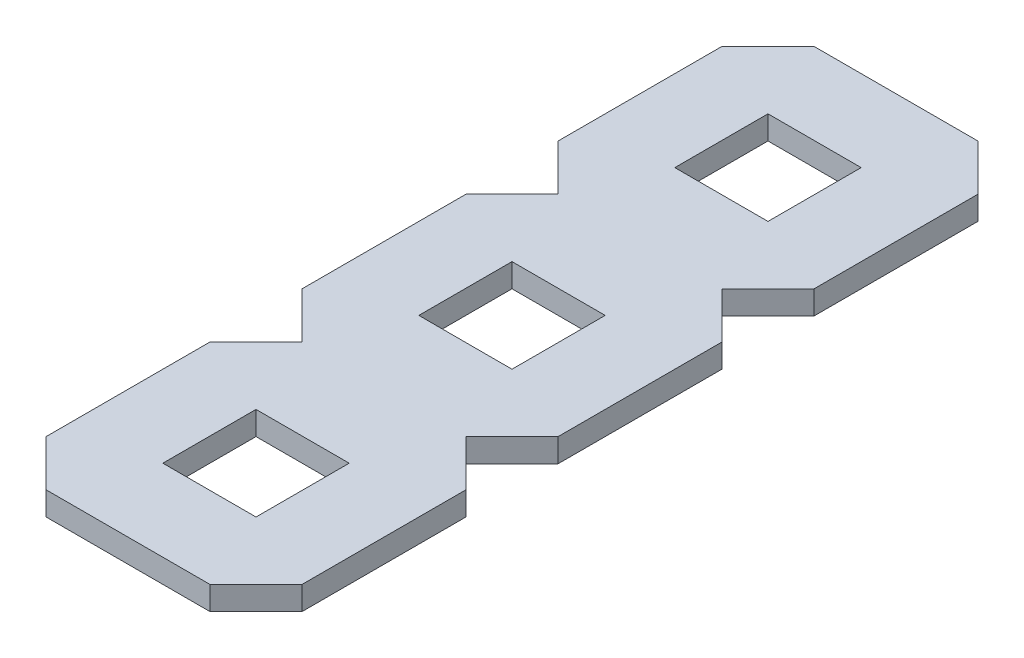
ISO-10303-21;
HEADER;
FILE_DESCRIPTION(('STEP AP214'),'2;1');
FILE_NAME('part.step','',(''),(''),'','','');
FILE_SCHEMA(('AUTOMOTIVE_DESIGN { 1 0 10303 214 1 1 1 1 }'));
ENDSEC;
DATA;
#1=APPLICATION_CONTEXT('core data for automotive mechanical design processes');
#2=APPLICATION_PROTOCOL_DEFINITION('international standard','automotive_design',2000,#1);
#3=PRODUCT_CONTEXT('',#1,'mechanical');
#4=PRODUCT('Part','Part','',(#3));
#5=PRODUCT_RELATED_PRODUCT_CATEGORY('part','',(#4));
#6=PRODUCT_DEFINITION_FORMATION('','',#4);
#7=PRODUCT_DEFINITION_CONTEXT('part definition',#1,'design');
#8=PRODUCT_DEFINITION('design','',#6,#7);
#9=PRODUCT_DEFINITION_SHAPE('','',#8);
#10=(LENGTH_UNIT() NAMED_UNIT(*) SI_UNIT(.MILLI.,.METRE.));
#11=(NAMED_UNIT(*) PLANE_ANGLE_UNIT() SI_UNIT($,.RADIAN.));
#12=(NAMED_UNIT(*) SI_UNIT($,.STERADIAN.) SOLID_ANGLE_UNIT());
#13=UNCERTAINTY_MEASURE_WITH_UNIT(LENGTH_MEASURE(1.E-05),#10,'distance_accuracy_value','');
#14=(GEOMETRIC_REPRESENTATION_CONTEXT(3) GLOBAL_UNCERTAINTY_ASSIGNED_CONTEXT((#13)) GLOBAL_UNIT_ASSIGNED_CONTEXT((#10,
#11,#12)) REPRESENTATION_CONTEXT('',''));
#15=CARTESIAN_POINT('',(0.,0.,0.));
#16=DIRECTION('',(0.,0.,1.));
#17=DIRECTION('',(1.,0.,0.));
#18=AXIS2_PLACEMENT_3D('',#15,#16,#17);
#19=CARTESIAN_POINT('',(0.,0.,-27.6809850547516));
#20=DIRECTION('',(-0.70710678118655,0.,0.707106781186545));
#21=DIRECTION('',(0.707106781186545,0.,0.70710678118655));
#22=AXIS2_PLACEMENT_3D('',#19,#20,#21);
#23=PLANE('',#22);
#24=DIRECTION('',(0.707106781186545,0.,0.70710678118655));
#25=VECTOR('',#24,1.);
#26=CARTESIAN_POINT('',(0.,1.1684,-27.6809850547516));
#27=LINE('',#26,#25);
#28=CARTESIAN_POINT('',(0.,1.1684,-27.6809850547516));
#29=VERTEX_POINT('',#28);
#30=CARTESIAN_POINT('',(2.28098505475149,1.1684,-25.4));
#31=VERTEX_POINT('',#30);
#32=EDGE_CURVE('E285',#29,#31,#27,.T.);
#33=ORIENTED_EDGE('',*,*,#32,.F.);
#34=DIRECTION('',(0.,1.,0.));
#35=VECTOR('',#34,1.);
#36=CARTESIAN_POINT('',(0.,0.,-27.6809850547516));
#37=LINE('',#36,#35);
#38=CARTESIAN_POINT('',(0.,0.,-27.6809850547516));
#39=VERTEX_POINT('',#38);
#40=EDGE_CURVE('E41',#39,#29,#37,.T.);
#41=ORIENTED_EDGE('',*,*,#40,.F.);
#42=DIRECTION('',(0.707106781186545,0.,0.70710678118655));
#43=VECTOR('',#42,1.);
#44=CARTESIAN_POINT('',(0.,0.,-27.6809850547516));
#45=LINE('',#44,#43);
#46=CARTESIAN_POINT('',(2.28098505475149,0.,-25.4));
#47=VERTEX_POINT('',#46);
#48=EDGE_CURVE('E306',#39,#47,#45,.T.);
#49=ORIENTED_EDGE('',*,*,#48,.T.);
#50=DIRECTION('',(0.,1.,0.));
#51=VECTOR('',#50,1.);
#52=CARTESIAN_POINT('',(2.28098505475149,0.,-25.4));
#53=LINE('',#52,#51);
#54=EDGE_CURVE('E11',#47,#31,#53,.T.);
#55=ORIENTED_EDGE('',*,*,#54,.T.);
#56=EDGE_LOOP('',(#33,#41,#49,#55));
#57=FACE_BOUND('',#56,.T.);
#58=ADVANCED_FACE('F32',(#57),#23,.T.);
#59=CARTESIAN_POINT('',(0.,0.,-35.8190149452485));
#60=DIRECTION('',(-1.,0.,0.));
#61=DIRECTION('',(0.,0.,1.));
#62=AXIS2_PLACEMENT_3D('',#59,#60,#61);
#63=PLANE('',#62);
#64=DIRECTION('',(0.,0.,1.));
#65=VECTOR('',#64,1.);
#66=CARTESIAN_POINT('',(0.,1.1684,-35.8190149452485));
#67=LINE('',#66,#65);
#68=CARTESIAN_POINT('',(0.,1.1684,-35.8190149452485));
#69=VERTEX_POINT('',#68);
#70=EDGE_CURVE('E329',#69,#29,#67,.T.);
#71=ORIENTED_EDGE('',*,*,#70,.F.);
#72=DIRECTION('',(0.,1.,0.));
#73=VECTOR('',#72,1.);
#74=CARTESIAN_POINT('',(0.,0.,-35.8190149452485));
#75=LINE('',#74,#73);
#76=CARTESIAN_POINT('',(0.,0.,-35.8190149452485));
#77=VERTEX_POINT('',#76);
#78=EDGE_CURVE('E335',#77,#69,#75,.T.);
#79=ORIENTED_EDGE('',*,*,#78,.F.);
#80=DIRECTION('',(0.,0.,1.));
#81=VECTOR('',#80,1.);
#82=CARTESIAN_POINT('',(0.,0.,-35.8190149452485));
#83=LINE('',#82,#81);
#84=EDGE_CURVE('E303',#77,#39,#83,.T.);
#85=ORIENTED_EDGE('',*,*,#84,.T.);
#86=ORIENTED_EDGE('',*,*,#40,.T.);
#87=EDGE_LOOP('',(#71,#79,#85,#86));
#88=FACE_BOUND('',#87,.T.);
#89=ADVANCED_FACE('F371',(#88),#63,.T.);
#90=CARTESIAN_POINT('',(2.28098505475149,0.,-38.1));
#91=DIRECTION('',(-0.707106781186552,0.,-0.707106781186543));
#92=DIRECTION('',(-0.707106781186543,0.,0.707106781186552));
#93=AXIS2_PLACEMENT_3D('',#90,#91,#92);
#94=PLANE('',#93);
#95=DIRECTION('',(-0.707106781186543,0.,0.707106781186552));
#96=VECTOR('',#95,1.);
#97=CARTESIAN_POINT('',(2.28098505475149,1.1684,-38.1));
#98=LINE('',#97,#96);
#99=CARTESIAN_POINT('',(2.28098505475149,1.1684,-38.1));
#100=VERTEX_POINT('',#99);
#101=EDGE_CURVE('E326',#100,#69,#98,.T.);
#102=ORIENTED_EDGE('',*,*,#101,.F.);
#103=DIRECTION('',(0.,1.,0.));
#104=VECTOR('',#103,1.);
#105=CARTESIAN_POINT('',(2.28098505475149,0.,-38.1));
#106=LINE('',#105,#104);
#107=CARTESIAN_POINT('',(2.28098505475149,0.,-38.1));
#108=VERTEX_POINT('',#107);
#109=EDGE_CURVE('E337',#108,#100,#106,.T.);
#110=ORIENTED_EDGE('',*,*,#109,.F.);
#111=DIRECTION('',(-0.707106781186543,0.,0.707106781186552));
#112=VECTOR('',#111,1.);
#113=CARTESIAN_POINT('',(2.28098505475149,0.,-38.1));
#114=LINE('',#113,#112);
#115=EDGE_CURVE('E300',#108,#77,#114,.T.);
#116=ORIENTED_EDGE('',*,*,#115,.T.);
#117=ORIENTED_EDGE('',*,*,#78,.T.);
#118=EDGE_LOOP('',(#102,#110,#116,#117));
#119=FACE_BOUND('',#118,.T.);
#120=ADVANCED_FACE('F377',(#119),#94,.T.);
#121=CARTESIAN_POINT('',(0.,0.,-40.3809850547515));
#122=DIRECTION('',(-0.707106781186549,0.,0.707106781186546));
#123=DIRECTION('',(0.707106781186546,0.,0.707106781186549));
#124=AXIS2_PLACEMENT_3D('',#121,#122,#123);
#125=PLANE('',#124);
#126=DIRECTION('',(0.707106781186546,0.,0.707106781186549));
#127=VECTOR('',#126,1.);
#128=CARTESIAN_POINT('',(0.,1.1684,-40.3809850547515));
#129=LINE('',#128,#127);
#130=CARTESIAN_POINT('',(0.,1.1684,-40.3809850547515));
#131=VERTEX_POINT('',#130);
#132=EDGE_CURVE('E323',#131,#100,#129,.T.);
#133=ORIENTED_EDGE('',*,*,#132,.F.);
#134=DIRECTION('',(0.,1.,0.));
#135=VECTOR('',#134,1.);
#136=CARTESIAN_POINT('',(0.,0.,-40.3809850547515));
#137=LINE('',#136,#135);
#138=CARTESIAN_POINT('',(0.,0.,-40.3809850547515));
#139=VERTEX_POINT('',#138);
#140=EDGE_CURVE('E339',#139,#131,#137,.T.);
#141=ORIENTED_EDGE('',*,*,#140,.F.);
#142=DIRECTION('',(0.707106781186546,0.,0.707106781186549));
#143=VECTOR('',#142,1.);
#144=CARTESIAN_POINT('',(0.,0.,-40.3809850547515));
#145=LINE('',#144,#143);
#146=EDGE_CURVE('E297',#139,#108,#145,.T.);
#147=ORIENTED_EDGE('',*,*,#146,.T.);
#148=ORIENTED_EDGE('',*,*,#109,.T.);
#149=EDGE_LOOP('',(#133,#141,#147,#148));
#150=FACE_BOUND('',#149,.T.);
#151=ADVANCED_FACE('F385',(#150),#125,.T.);
#152=CARTESIAN_POINT('',(0.,0.,-48.5190149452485));
#153=DIRECTION('',(-1.,0.,0.));
#154=DIRECTION('',(0.,0.,1.));
#155=AXIS2_PLACEMENT_3D('',#152,#153,#154);
#156=PLANE('',#155);
#157=DIRECTION('',(0.,0.,1.));
#158=VECTOR('',#157,1.);
#159=CARTESIAN_POINT('',(0.,1.1684,-48.5190149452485));
#160=LINE('',#159,#158);
#161=CARTESIAN_POINT('',(0.,1.1684,-48.5190149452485));
#162=VERTEX_POINT('',#161);
#163=EDGE_CURVE('E320',#162,#131,#160,.T.);
#164=ORIENTED_EDGE('',*,*,#163,.F.);
#165=DIRECTION('',(0.,1.,0.));
#166=VECTOR('',#165,1.);
#167=CARTESIAN_POINT('',(0.,0.,-48.5190149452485));
#168=LINE('',#167,#166);
#169=CARTESIAN_POINT('',(0.,0.,-48.5190149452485));
#170=VERTEX_POINT('',#169);
#171=EDGE_CURVE('E341',#170,#162,#168,.T.);
#172=ORIENTED_EDGE('',*,*,#171,.F.);
#173=DIRECTION('',(0.,0.,1.));
#174=VECTOR('',#173,1.);
#175=CARTESIAN_POINT('',(0.,0.,-48.5190149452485));
#176=LINE('',#175,#174);
#177=EDGE_CURVE('E294',#170,#139,#176,.T.);
#178=ORIENTED_EDGE('',*,*,#177,.T.);
#179=ORIENTED_EDGE('',*,*,#140,.T.);
#180=EDGE_LOOP('',(#164,#172,#178,#179));
#181=FACE_BOUND('',#180,.T.);
#182=ADVANCED_FACE('F389',(#181),#156,.T.);
#183=CARTESIAN_POINT('',(2.28098505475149,0.,-50.8));
#184=DIRECTION('',(-0.707106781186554,0.,-0.707106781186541));
#185=DIRECTION('',(-0.707106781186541,0.,0.707106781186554));
#186=AXIS2_PLACEMENT_3D('',#183,#184,#185);
#187=PLANE('',#186);
#188=DIRECTION('',(-0.707106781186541,0.,0.707106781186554));
#189=VECTOR('',#188,1.);
#190=CARTESIAN_POINT('',(2.28098505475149,1.1684,-50.8));
#191=LINE('',#190,#189);
#192=CARTESIAN_POINT('',(2.28098505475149,1.1684,-50.8));
#193=VERTEX_POINT('',#192);
#194=EDGE_CURVE('E317',#193,#162,#191,.T.);
#195=ORIENTED_EDGE('',*,*,#194,.F.);
#196=DIRECTION('',(0.,1.,0.));
#197=VECTOR('',#196,1.);
#198=CARTESIAN_POINT('',(2.28098505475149,0.,-50.8));
#199=LINE('',#198,#197);
#200=CARTESIAN_POINT('',(2.28098505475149,0.,-50.8));
#201=VERTEX_POINT('',#200);
#202=EDGE_CURVE('E343',#201,#193,#199,.T.);
#203=ORIENTED_EDGE('',*,*,#202,.F.);
#204=DIRECTION('',(-0.707106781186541,0.,0.707106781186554));
#205=VECTOR('',#204,1.);
#206=CARTESIAN_POINT('',(2.28098505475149,0.,-50.8));
#207=LINE('',#206,#205);
#208=EDGE_CURVE('E291',#201,#170,#207,.T.);
#209=ORIENTED_EDGE('',*,*,#208,.T.);
#210=ORIENTED_EDGE('',*,*,#171,.T.);
#211=EDGE_LOOP('',(#195,#203,#209,#210));
#212=FACE_BOUND('',#211,.T.);
#213=ADVANCED_FACE('F393',(#212),#187,.T.);
#214=CARTESIAN_POINT('',(0.,0.,-53.0809850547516));
#215=DIRECTION('',(-0.707106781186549,0.,0.707106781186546));
#216=DIRECTION('',(0.707106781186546,0.,0.707106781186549));
#217=AXIS2_PLACEMENT_3D('',#214,#215,#216);
#218=PLANE('',#217);
#219=DIRECTION('',(0.707106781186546,0.,0.707106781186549));
#220=VECTOR('',#219,1.);
#221=CARTESIAN_POINT('',(0.,1.1684,-53.0809850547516));
#222=LINE('',#221,#220);
#223=CARTESIAN_POINT('',(0.,1.1684,-53.0809850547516));
#224=VERTEX_POINT('',#223);
#225=EDGE_CURVE('E314',#224,#193,#222,.T.);
#226=ORIENTED_EDGE('',*,*,#225,.F.);
#227=DIRECTION('',(0.,1.,0.));
#228=VECTOR('',#227,1.);
#229=CARTESIAN_POINT('',(0.,0.,-53.0809850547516));
#230=LINE('',#229,#228);
#231=CARTESIAN_POINT('',(0.,0.,-53.0809850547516));
#232=VERTEX_POINT('',#231);
#233=EDGE_CURVE('E345',#232,#224,#230,.T.);
#234=ORIENTED_EDGE('',*,*,#233,.F.);
#235=DIRECTION('',(0.707106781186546,0.,0.707106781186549));
#236=VECTOR('',#235,1.);
#237=CARTESIAN_POINT('',(0.,0.,-53.0809850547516));
#238=LINE('',#237,#236);
#239=EDGE_CURVE('E288',#232,#201,#238,.T.);
#240=ORIENTED_EDGE('',*,*,#239,.T.);
#241=ORIENTED_EDGE('',*,*,#202,.T.);
#242=EDGE_LOOP('',(#226,#234,#240,#241));
#243=FACE_BOUND('',#242,.T.);
#244=ADVANCED_FACE('F368',(#243),#218,.T.);
#245=CARTESIAN_POINT('',(0.,0.,-61.2190149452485));
#246=DIRECTION('',(-1.,0.,0.));
#247=DIRECTION('',(0.,0.,1.));
#248=AXIS2_PLACEMENT_3D('',#245,#246,#247);
#249=PLANE('',#248);
#250=DIRECTION('',(0.,0.,1.));
#251=VECTOR('',#250,1.);
#252=CARTESIAN_POINT('',(0.,1.1684,-61.2190149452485));
#253=LINE('',#252,#251);
#254=CARTESIAN_POINT('',(0.,1.1684,-61.2190149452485));
#255=VERTEX_POINT('',#254);
#256=EDGE_CURVE('E311',#255,#224,#253,.T.);
#257=ORIENTED_EDGE('',*,*,#256,.F.);
#258=DIRECTION('',(0.,1.,0.));
#259=VECTOR('',#258,1.);
#260=CARTESIAN_POINT('',(0.,0.,-61.2190149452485));
#261=LINE('',#260,#259);
#262=CARTESIAN_POINT('',(0.,0.,-61.2190149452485));
#263=VERTEX_POINT('',#262);
#264=EDGE_CURVE('E346',#263,#255,#261,.T.);
#265=ORIENTED_EDGE('',*,*,#264,.F.);
#266=DIRECTION('',(0.,0.,1.));
#267=VECTOR('',#266,1.);
#268=CARTESIAN_POINT('',(0.,0.,-61.2190149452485));
#269=LINE('',#268,#267);
#270=EDGE_CURVE('E284',#263,#232,#269,.T.);
#271=ORIENTED_EDGE('',*,*,#270,.T.);
#272=ORIENTED_EDGE('',*,*,#233,.T.);
#273=EDGE_LOOP('',(#257,#265,#271,#272));
#274=FACE_BOUND('',#273,.T.);
#275=ADVANCED_FACE('F361',(#274),#249,.T.);
#276=CARTESIAN_POINT('',(2.28098505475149,0.,-63.5));
#277=DIRECTION('',(-0.707106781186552,0.,-0.707106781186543));
#278=DIRECTION('',(-0.707106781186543,0.,0.707106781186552));
#279=AXIS2_PLACEMENT_3D('',#276,#277,#278);
#280=PLANE('',#279);
#281=DIRECTION('',(-0.707106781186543,0.,0.707106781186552));
#282=VECTOR('',#281,1.);
#283=CARTESIAN_POINT('',(2.28098505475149,1.1684,-63.5));
#284=LINE('',#283,#282);
#285=CARTESIAN_POINT('',(2.28098505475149,1.1684,-63.5));
#286=VERTEX_POINT('',#285);
#287=EDGE_CURVE('E253',#286,#255,#284,.T.);
#288=ORIENTED_EDGE('',*,*,#287,.F.);
#289=DIRECTION('',(0.,1.,0.));
#290=VECTOR('',#289,1.);
#291=CARTESIAN_POINT('',(2.28098505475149,0.,-63.5));
#292=LINE('',#291,#290);
#293=CARTESIAN_POINT('',(2.28098505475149,0.,-63.5));
#294=VERTEX_POINT('',#293);
#295=EDGE_CURVE('E36',#294,#286,#292,.T.);
#296=ORIENTED_EDGE('',*,*,#295,.F.);
#297=DIRECTION('',(-0.707106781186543,0.,0.707106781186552));
#298=VECTOR('',#297,1.);
#299=CARTESIAN_POINT('',(2.28098505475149,0.,-63.5));
#300=LINE('',#299,#298);
#301=EDGE_CURVE('E281',#294,#263,#300,.T.);
#302=ORIENTED_EDGE('',*,*,#301,.T.);
#303=ORIENTED_EDGE('',*,*,#264,.T.);
#304=EDGE_LOOP('',(#288,#296,#302,#303));
#305=FACE_BOUND('',#304,.T.);
#306=ADVANCED_FACE('F34',(#305),#280,.T.);
#307=CARTESIAN_POINT('',(0.,0.,0.));
#308=DIRECTION('',(0.,1.,0.));
#309=DIRECTION('',(0.,0.,1.));
#310=AXIS2_PLACEMENT_3D('',#307,#308,#309);
#311=PLANE('',#310);
#312=DIRECTION('',(0.707106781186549,0.,0.707106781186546));
#313=VECTOR('',#312,1.);
#314=CARTESIAN_POINT('',(12.6999999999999,0.,-61.2190149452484));
#315=LINE('',#314,#313);
#316=CARTESIAN_POINT('',(10.4190149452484,0.,-63.5));
#317=VERTEX_POINT('',#316);
#318=CARTESIAN_POINT('',(12.6999999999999,0.,-61.2190149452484));
#319=VERTEX_POINT('',#318);
#320=EDGE_CURVE('E272',#317,#319,#315,.T.);
#321=ORIENTED_EDGE('',*,*,#320,.T.);
#322=DIRECTION('',(0.,0.,1.));
#323=VECTOR('',#322,1.);
#324=CARTESIAN_POINT('',(12.6999999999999,0.,0.));
#325=LINE('',#324,#323);
#326=CARTESIAN_POINT('',(12.6999999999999,0.,-53.0809850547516));
#327=VERTEX_POINT('',#326);
#328=EDGE_CURVE('E248',#319,#327,#325,.T.);
#329=ORIENTED_EDGE('',*,*,#328,.T.);
#330=DIRECTION('',(-0.70710678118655,0.,0.707106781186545));
#331=VECTOR('',#330,1.);
#332=CARTESIAN_POINT('',(10.4190149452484,0.,-50.8));
#333=LINE('',#332,#331);
#334=CARTESIAN_POINT('',(10.4190149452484,0.,-50.8));
#335=VERTEX_POINT('',#334);
#336=EDGE_CURVE('E433',#327,#335,#333,.T.);
#337=ORIENTED_EDGE('',*,*,#336,.T.);
#338=DIRECTION('',(0.707106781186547,0.,0.707106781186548));
#339=VECTOR('',#338,1.);
#340=CARTESIAN_POINT('',(12.6999999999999,0.,-48.5190149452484));
#341=LINE('',#340,#339);
#342=CARTESIAN_POINT('',(12.6999999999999,0.,-48.5190149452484));
#343=VERTEX_POINT('',#342);
#344=EDGE_CURVE('E436',#335,#343,#341,.T.);
#345=ORIENTED_EDGE('',*,*,#344,.T.);
#346=CARTESIAN_POINT('',(12.6999999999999,0.,-40.3809850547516));
#347=VERTEX_POINT('',#346);
#348=EDGE_CURVE('E428',#343,#347,#325,.T.);
#349=ORIENTED_EDGE('',*,*,#348,.T.);
#350=DIRECTION('',(-0.707106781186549,0.,0.707106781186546));
#351=VECTOR('',#350,1.);
#352=CARTESIAN_POINT('',(10.4190149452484,0.,-38.1));
#353=LINE('',#352,#351);
#354=CARTESIAN_POINT('',(10.4190149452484,0.,-38.1));
#355=VERTEX_POINT('',#354);
#356=EDGE_CURVE('E551',#347,#355,#353,.T.);
#357=ORIENTED_EDGE('',*,*,#356,.T.);
#358=DIRECTION('',(0.707106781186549,0.,0.707106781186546));
#359=VECTOR('',#358,1.);
#360=CARTESIAN_POINT('',(12.6999999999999,0.,-35.8190149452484));
#361=LINE('',#360,#359);
#362=CARTESIAN_POINT('',(12.6999999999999,0.,-35.8190149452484));
#363=VERTEX_POINT('',#362);
#364=EDGE_CURVE('E554',#355,#363,#361,.T.);
#365=ORIENTED_EDGE('',*,*,#364,.T.);
#366=CARTESIAN_POINT('',(12.6999999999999,0.,-27.6809850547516));
#367=VERTEX_POINT('',#366);
#368=EDGE_CURVE('E426',#363,#367,#325,.T.);
#369=ORIENTED_EDGE('',*,*,#368,.T.);
#370=DIRECTION('',(-0.707106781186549,0.,0.707106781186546));
#371=VECTOR('',#370,1.);
#372=CARTESIAN_POINT('',(10.4190149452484,0.,-25.4));
#373=LINE('',#372,#371);
#374=CARTESIAN_POINT('',(10.4190149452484,0.,-25.4));
#375=VERTEX_POINT('',#374);
#376=EDGE_CURVE('E425',#367,#375,#373,.T.);
#377=ORIENTED_EDGE('',*,*,#376,.T.);
#378=DIRECTION('',(-1.,0.,0.));
#379=VECTOR('',#378,1.);
#380=CARTESIAN_POINT('',(0.,0.,-25.4));
#381=LINE('',#380,#379);
#382=EDGE_CURVE('E357',#375,#47,#381,.T.);
#383=ORIENTED_EDGE('',*,*,#382,.T.);
#384=ORIENTED_EDGE('',*,*,#48,.F.);
#385=ORIENTED_EDGE('',*,*,#84,.F.);
#386=ORIENTED_EDGE('',*,*,#115,.F.);
#387=ORIENTED_EDGE('',*,*,#146,.F.);
#388=ORIENTED_EDGE('',*,*,#177,.F.);
#389=ORIENTED_EDGE('',*,*,#208,.F.);
#390=ORIENTED_EDGE('',*,*,#239,.F.);
#391=ORIENTED_EDGE('',*,*,#270,.F.);
#392=ORIENTED_EDGE('',*,*,#301,.F.);
#393=DIRECTION('',(1.,0.,0.));
#394=VECTOR('',#393,1.);
#395=CARTESIAN_POINT('',(0.,0.,-63.5));
#396=LINE('',#395,#394);
#397=EDGE_CURVE('E355',#294,#317,#396,.T.);
#398=ORIENTED_EDGE('',*,*,#397,.T.);
#399=EDGE_LOOP('',(#321,#329,#337,#345,#349,#357,#365,#369,#377,#383,#384,#385,#386,#387,#388,
#389,#390,#391,#392,#398));
#400=FACE_BOUND('',#399,.T.);
#401=DIRECTION('',(0.,0.,-1.));
#402=VECTOR('',#401,1.);
#403=CARTESIAN_POINT('',(8.66139999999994,0.,-34.0614));
#404=LINE('',#403,#402);
#405=CARTESIAN_POINT('',(8.66139999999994,0.,-29.4386));
#406=VERTEX_POINT('',#405);
#407=CARTESIAN_POINT('',(8.66139999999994,0.,-34.0614));
#408=VERTEX_POINT('',#407);
#409=EDGE_CURVE('E466',#406,#408,#404,.T.);
#410=ORIENTED_EDGE('',*,*,#409,.T.);
#411=DIRECTION('',(-1.,0.,0.));
#412=VECTOR('',#411,1.);
#413=CARTESIAN_POINT('',(4.03859999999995,0.,-34.0614));
#414=LINE('',#413,#412);
#415=CARTESIAN_POINT('',(4.03859999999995,0.,-34.0614));
#416=VERTEX_POINT('',#415);
#417=EDGE_CURVE('E458',#408,#416,#414,.T.);
#418=ORIENTED_EDGE('',*,*,#417,.T.);
#419=DIRECTION('',(0.,0.,1.));
#420=VECTOR('',#419,1.);
#421=CARTESIAN_POINT('',(4.03859999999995,0.,-29.4386));
#422=LINE('',#421,#420);
#423=CARTESIAN_POINT('',(4.03859999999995,0.,-29.4386));
#424=VERTEX_POINT('',#423);
#425=EDGE_CURVE('E461',#416,#424,#422,.T.);
#426=ORIENTED_EDGE('',*,*,#425,.T.);
#427=DIRECTION('',(1.,0.,0.));
#428=VECTOR('',#427,1.);
#429=CARTESIAN_POINT('',(8.66139999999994,0.,-29.4386));
#430=LINE('',#429,#428);
#431=EDGE_CURVE('E49',#424,#406,#430,.T.);
#432=ORIENTED_EDGE('',*,*,#431,.T.);
#433=EDGE_LOOP('',(#410,#418,#426,#432));
#434=FACE_BOUND('',#433,.T.);
#435=DIRECTION('',(0.,0.,-1.));
#436=VECTOR('',#435,1.);
#437=CARTESIAN_POINT('',(8.66139999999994,0.,-46.7614));
#438=LINE('',#437,#436);
#439=CARTESIAN_POINT('',(8.66139999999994,0.,-42.1386));
#440=VERTEX_POINT('',#439);
#441=CARTESIAN_POINT('',(8.66139999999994,0.,-46.7614));
#442=VERTEX_POINT('',#441);
#443=EDGE_CURVE('E497',#440,#442,#438,.T.);
#444=ORIENTED_EDGE('',*,*,#443,.T.);
#445=DIRECTION('',(-1.,0.,0.));
#446=VECTOR('',#445,1.);
#447=CARTESIAN_POINT('',(4.03859999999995,0.,-46.7614));
#448=LINE('',#447,#446);
#449=CARTESIAN_POINT('',(4.03859999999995,0.,-46.7614));
#450=VERTEX_POINT('',#449);
#451=EDGE_CURVE('E487',#442,#450,#448,.T.);
#452=ORIENTED_EDGE('',*,*,#451,.T.);
#453=DIRECTION('',(0.,0.,1.));
#454=VECTOR('',#453,1.);
#455=CARTESIAN_POINT('',(4.03859999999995,0.,-42.1386));
#456=LINE('',#455,#454);
#457=CARTESIAN_POINT('',(4.03859999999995,0.,-42.1386));
#458=VERTEX_POINT('',#457);
#459=EDGE_CURVE('E490',#450,#458,#456,.T.);
#460=ORIENTED_EDGE('',*,*,#459,.T.);
#461=DIRECTION('',(1.,0.,0.));
#462=VECTOR('',#461,1.);
#463=CARTESIAN_POINT('',(8.66139999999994,0.,-42.1386));
#464=LINE('',#463,#462);
#465=EDGE_CURVE('E494',#458,#440,#464,.T.);
#466=ORIENTED_EDGE('',*,*,#465,.T.);
#467=EDGE_LOOP('',(#444,#452,#460,#466));
#468=FACE_BOUND('',#467,.T.);
#469=DIRECTION('',(0.,0.,-1.));
#470=VECTOR('',#469,1.);
#471=CARTESIAN_POINT('',(8.66139999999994,0.,-59.4614));
#472=LINE('',#471,#470);
#473=CARTESIAN_POINT('',(8.66139999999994,0.,-54.8386));
#474=VERTEX_POINT('',#473);
#475=CARTESIAN_POINT('',(8.66139999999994,0.,-59.4614));
#476=VERTEX_POINT('',#475);
#477=EDGE_CURVE('E529',#474,#476,#472,.T.);
#478=ORIENTED_EDGE('',*,*,#477,.T.);
#479=DIRECTION('',(-1.,0.,0.));
#480=VECTOR('',#479,1.);
#481=CARTESIAN_POINT('',(4.03859999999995,0.,-59.4614));
#482=LINE('',#481,#480);
#483=CARTESIAN_POINT('',(4.03859999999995,0.,-59.4614));
#484=VERTEX_POINT('',#483);
#485=EDGE_CURVE('E519',#476,#484,#482,.T.);
#486=ORIENTED_EDGE('',*,*,#485,.T.);
#487=DIRECTION('',(0.,0.,1.));
#488=VECTOR('',#487,1.);
#489=CARTESIAN_POINT('',(4.03859999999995,0.,-54.8386));
#490=LINE('',#489,#488);
#491=CARTESIAN_POINT('',(4.03859999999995,0.,-54.8386));
#492=VERTEX_POINT('',#491);
#493=EDGE_CURVE('E522',#484,#492,#490,.T.);
#494=ORIENTED_EDGE('',*,*,#493,.T.);
#495=DIRECTION('',(1.,0.,0.));
#496=VECTOR('',#495,1.);
#497=CARTESIAN_POINT('',(8.66139999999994,0.,-54.8386));
#498=LINE('',#497,#496);
#499=EDGE_CURVE('E526',#492,#474,#498,.T.);
#500=ORIENTED_EDGE('',*,*,#499,.T.);
#501=EDGE_LOOP('',(#478,#486,#494,#500));
#502=FACE_BOUND('',#501,.T.);
#503=ADVANCED_FACE('F360',(#400,#434,#468,#502),#311,.F.);
#504=CARTESIAN_POINT('',(0.,1.1684,0.));
#505=DIRECTION('',(0.,1.,0.));
#506=DIRECTION('',(0.,0.,1.));
#507=AXIS2_PLACEMENT_3D('',#504,#505,#506);
#508=PLANE('',#507);
#509=DIRECTION('',(0.,0.,1.));
#510=VECTOR('',#509,1.);
#511=CARTESIAN_POINT('',(12.6999999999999,1.1684,-65.7809850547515));
#512=LINE('',#511,#510);
#513=CARTESIAN_POINT('',(12.6999999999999,1.1684,-61.2190149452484));
#514=VERTEX_POINT('',#513);
#515=CARTESIAN_POINT('',(12.6999999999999,1.1684,-53.0809850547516));
#516=VERTEX_POINT('',#515);
#517=EDGE_CURVE('E245',#514,#516,#512,.T.);
#518=ORIENTED_EDGE('',*,*,#517,.F.);
#519=DIRECTION('',(0.707106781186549,0.,0.707106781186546));
#520=VECTOR('',#519,1.);
#521=CARTESIAN_POINT('',(12.6999999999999,1.1684,-61.2190149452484));
#522=LINE('',#521,#520);
#523=CARTESIAN_POINT('',(10.4190149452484,1.1684,-63.5));
#524=VERTEX_POINT('',#523);
#525=EDGE_CURVE('E262',#524,#514,#522,.T.);
#526=ORIENTED_EDGE('',*,*,#525,.F.);
#527=DIRECTION('',(1.,0.,0.));
#528=VECTOR('',#527,1.);
#529=CARTESIAN_POINT('',(63.4999999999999,1.1684,-63.5));
#530=LINE('',#529,#528);
#531=EDGE_CURVE('E353',#286,#524,#530,.T.);
#532=ORIENTED_EDGE('',*,*,#531,.F.);
#533=ORIENTED_EDGE('',*,*,#287,.T.);
#534=ORIENTED_EDGE('',*,*,#256,.T.);
#535=ORIENTED_EDGE('',*,*,#225,.T.);
#536=ORIENTED_EDGE('',*,*,#194,.T.);
#537=ORIENTED_EDGE('',*,*,#163,.T.);
#538=ORIENTED_EDGE('',*,*,#132,.T.);
#539=ORIENTED_EDGE('',*,*,#101,.T.);
#540=ORIENTED_EDGE('',*,*,#70,.T.);
#541=ORIENTED_EDGE('',*,*,#32,.T.);
#542=DIRECTION('',(-1.,0.,0.));
#543=VECTOR('',#542,1.);
#544=CARTESIAN_POINT('',(-3.9298559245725,1.1684,-25.4));
#545=LINE('',#544,#543);
#546=CARTESIAN_POINT('',(10.4190149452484,1.1684,-25.4));
#547=VERTEX_POINT('',#546);
#548=EDGE_CURVE('E266',#547,#31,#545,.T.);
#549=ORIENTED_EDGE('',*,*,#548,.F.);
#550=DIRECTION('',(-0.707106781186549,0.,0.707106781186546));
#551=VECTOR('',#550,1.);
#552=CARTESIAN_POINT('',(10.4190149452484,1.1684,-25.4));
#553=LINE('',#552,#551);
#554=CARTESIAN_POINT('',(12.6999999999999,1.1684,-27.6809850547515));
#555=VERTEX_POINT('',#554);
#556=EDGE_CURVE('E446',#555,#547,#553,.T.);
#557=ORIENTED_EDGE('',*,*,#556,.F.);
#558=CARTESIAN_POINT('',(12.6999999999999,1.1684,-35.8190149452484));
#559=VERTEX_POINT('',#558);
#560=EDGE_CURVE('E269',#559,#555,#512,.T.);
#561=ORIENTED_EDGE('',*,*,#560,.F.);
#562=DIRECTION('',(0.707106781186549,0.,0.707106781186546));
#563=VECTOR('',#562,1.);
#564=CARTESIAN_POINT('',(12.6999999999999,1.1684,-35.8190149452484));
#565=LINE('',#564,#563);
#566=CARTESIAN_POINT('',(10.4190149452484,1.1684,-38.1));
#567=VERTEX_POINT('',#566);
#568=EDGE_CURVE('E555',#567,#559,#565,.T.);
#569=ORIENTED_EDGE('',*,*,#568,.F.);
#570=DIRECTION('',(-0.707106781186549,0.,0.707106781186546));
#571=VECTOR('',#570,1.);
#572=CARTESIAN_POINT('',(10.4190149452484,1.1684,-38.1));
#573=LINE('',#572,#571);
#574=CARTESIAN_POINT('',(12.6999999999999,1.1684,-40.3809850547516));
#575=VERTEX_POINT('',#574);
#576=EDGE_CURVE('E544',#575,#567,#573,.T.);
#577=ORIENTED_EDGE('',*,*,#576,.F.);
#578=CARTESIAN_POINT('',(12.6999999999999,1.1684,-48.5190149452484));
#579=VERTEX_POINT('',#578);
#580=EDGE_CURVE('E267',#579,#575,#512,.T.);
#581=ORIENTED_EDGE('',*,*,#580,.F.);
#582=DIRECTION('',(0.707106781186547,0.,0.707106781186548));
#583=VECTOR('',#582,1.);
#584=CARTESIAN_POINT('',(12.6999999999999,1.1684,-48.5190149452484));
#585=LINE('',#584,#583);
#586=CARTESIAN_POINT('',(10.4190149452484,1.1684,-50.8));
#587=VERTEX_POINT('',#586);
#588=EDGE_CURVE('E437',#587,#579,#585,.T.);
#589=ORIENTED_EDGE('',*,*,#588,.F.);
#590=DIRECTION('',(-0.70710678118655,0.,0.707106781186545));
#591=VECTOR('',#590,1.);
#592=CARTESIAN_POINT('',(10.4190149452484,1.1684,-50.8));
#593=LINE('',#592,#591);
#594=EDGE_CURVE('E265',#516,#587,#593,.T.);
#595=ORIENTED_EDGE('',*,*,#594,.F.);
#596=EDGE_LOOP('',(#518,#526,#532,#533,#534,#535,#536,#537,#538,#539,#540,#541,#549,#557,#561,
#569,#577,#581,#589,#595));
#597=FACE_BOUND('',#596,.T.);
#598=DIRECTION('',(-1.,0.,0.));
#599=VECTOR('',#598,1.);
#600=CARTESIAN_POINT('',(4.03859999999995,1.1684,-34.0614));
#601=LINE('',#600,#599);
#602=CARTESIAN_POINT('',(8.66139999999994,1.1684,-34.0614));
#603=VERTEX_POINT('',#602);
#604=CARTESIAN_POINT('',(4.03859999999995,1.1684,-34.0614));
#605=VERTEX_POINT('',#604);
#606=EDGE_CURVE('E57',#603,#605,#601,.T.);
#607=ORIENTED_EDGE('',*,*,#606,.F.);
#608=DIRECTION('',(0.,0.,-1.));
#609=VECTOR('',#608,1.);
#610=CARTESIAN_POINT('',(8.66139999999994,1.1684,-34.0614));
#611=LINE('',#610,#609);
#612=CARTESIAN_POINT('',(8.66139999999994,1.1684,-29.4386));
#613=VERTEX_POINT('',#612);
#614=EDGE_CURVE('E462',#613,#603,#611,.T.);
#615=ORIENTED_EDGE('',*,*,#614,.F.);
#616=DIRECTION('',(1.,0.,0.));
#617=VECTOR('',#616,1.);
#618=CARTESIAN_POINT('',(8.66139999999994,1.1684,-29.4386));
#619=LINE('',#618,#617);
#620=CARTESIAN_POINT('',(4.03859999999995,1.1684,-29.4386));
#621=VERTEX_POINT('',#620);
#622=EDGE_CURVE('E474',#621,#613,#619,.T.);
#623=ORIENTED_EDGE('',*,*,#622,.F.);
#624=DIRECTION('',(0.,0.,1.));
#625=VECTOR('',#624,1.);
#626=CARTESIAN_POINT('',(4.03859999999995,1.1684,-29.4386));
#627=LINE('',#626,#625);
#628=EDGE_CURVE('E471',#605,#621,#627,.T.);
#629=ORIENTED_EDGE('',*,*,#628,.F.);
#630=EDGE_LOOP('',(#607,#615,#623,#629));
#631=FACE_BOUND('',#630,.T.);
#632=DIRECTION('',(-1.,0.,0.));
#633=VECTOR('',#632,1.);
#634=CARTESIAN_POINT('',(4.03859999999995,1.1684,-46.7614));
#635=LINE('',#634,#633);
#636=CARTESIAN_POINT('',(8.66139999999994,1.1684,-46.7614));
#637=VERTEX_POINT('',#636);
#638=CARTESIAN_POINT('',(4.03859999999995,1.1684,-46.7614));
#639=VERTEX_POINT('',#638);
#640=EDGE_CURVE('E481',#637,#639,#635,.T.);
#641=ORIENTED_EDGE('',*,*,#640,.F.);
#642=DIRECTION('',(0.,0.,-1.));
#643=VECTOR('',#642,1.);
#644=CARTESIAN_POINT('',(8.66139999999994,1.1684,-46.7614));
#645=LINE('',#644,#643);
#646=CARTESIAN_POINT('',(8.66139999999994,1.1684,-42.1386));
#647=VERTEX_POINT('',#646);
#648=EDGE_CURVE('E491',#647,#637,#645,.T.);
#649=ORIENTED_EDGE('',*,*,#648,.F.);
#650=DIRECTION('',(1.,0.,0.));
#651=VECTOR('',#650,1.);
#652=CARTESIAN_POINT('',(8.66139999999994,1.1684,-42.1386));
#653=LINE('',#652,#651);
#654=CARTESIAN_POINT('',(4.03859999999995,1.1684,-42.1386));
#655=VERTEX_POINT('',#654);
#656=EDGE_CURVE('E505',#655,#647,#653,.T.);
#657=ORIENTED_EDGE('',*,*,#656,.F.);
#658=DIRECTION('',(0.,0.,1.));
#659=VECTOR('',#658,1.);
#660=CARTESIAN_POINT('',(4.03859999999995,1.1684,-42.1386));
#661=LINE('',#660,#659);
#662=EDGE_CURVE('E502',#639,#655,#661,.T.);
#663=ORIENTED_EDGE('',*,*,#662,.F.);
#664=EDGE_LOOP('',(#641,#649,#657,#663));
#665=FACE_BOUND('',#664,.T.);
#666=DIRECTION('',(-1.,0.,0.));
#667=VECTOR('',#666,1.);
#668=CARTESIAN_POINT('',(4.03859999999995,1.1684,-59.4614));
#669=LINE('',#668,#667);
#670=CARTESIAN_POINT('',(8.66139999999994,1.1684,-59.4614));
#671=VERTEX_POINT('',#670);
#672=CARTESIAN_POINT('',(4.03859999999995,1.1684,-59.4614));
#673=VERTEX_POINT('',#672);
#674=EDGE_CURVE('E512',#671,#673,#669,.T.);
#675=ORIENTED_EDGE('',*,*,#674,.F.);
#676=DIRECTION('',(0.,0.,-1.));
#677=VECTOR('',#676,1.);
#678=CARTESIAN_POINT('',(8.66139999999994,1.1684,-59.4614));
#679=LINE('',#678,#677);
#680=CARTESIAN_POINT('',(8.66139999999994,1.1684,-54.8386));
#681=VERTEX_POINT('',#680);
#682=EDGE_CURVE('E523',#681,#671,#679,.T.);
#683=ORIENTED_EDGE('',*,*,#682,.F.);
#684=DIRECTION('',(1.,0.,0.));
#685=VECTOR('',#684,1.);
#686=CARTESIAN_POINT('',(8.66139999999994,1.1684,-54.8386));
#687=LINE('',#686,#685);
#688=CARTESIAN_POINT('',(4.03859999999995,1.1684,-54.8386));
#689=VERTEX_POINT('',#688);
#690=EDGE_CURVE('E537',#689,#681,#687,.T.);
#691=ORIENTED_EDGE('',*,*,#690,.F.);
#692=DIRECTION('',(0.,0.,1.));
#693=VECTOR('',#692,1.);
#694=CARTESIAN_POINT('',(4.03859999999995,1.1684,-54.8386));
#695=LINE('',#694,#693);
#696=EDGE_CURVE('E534',#673,#689,#695,.T.);
#697=ORIENTED_EDGE('',*,*,#696,.F.);
#698=EDGE_LOOP('',(#675,#683,#691,#697));
#699=FACE_BOUND('',#698,.T.);
#700=ADVANCED_FACE('F259',(#597,#631,#665,#699),#508,.T.);
#701=CARTESIAN_POINT('',(12.6999999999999,0.,-61.2190149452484));
#702=DIRECTION('',(-0.707106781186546,0.,0.707106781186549));
#703=DIRECTION('',(0.707106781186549,0.,0.707106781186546));
#704=AXIS2_PLACEMENT_3D('',#701,#702,#703);
#705=PLANE('',#704);
#706=ORIENTED_EDGE('',*,*,#525,.T.);
#707=DIRECTION('',(0.,1.,0.));
#708=VECTOR('',#707,1.);
#709=CARTESIAN_POINT('',(12.6999999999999,0.,-61.2190149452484));
#710=LINE('',#709,#708);
#711=EDGE_CURVE('E242',#319,#514,#710,.T.);
#712=ORIENTED_EDGE('',*,*,#711,.F.);
#713=ORIENTED_EDGE('',*,*,#320,.F.);
#714=DIRECTION('',(0.,1.,0.));
#715=VECTOR('',#714,1.);
#716=CARTESIAN_POINT('',(10.4190149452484,0.,-63.5));
#717=LINE('',#716,#715);
#718=EDGE_CURVE('E254',#317,#524,#717,.T.);
#719=ORIENTED_EDGE('',*,*,#718,.T.);
#720=EDGE_LOOP('',(#706,#712,#713,#719));
#721=FACE_BOUND('',#720,.T.);
#722=ADVANCED_FACE('F271',(#721),#705,.F.);
#723=CARTESIAN_POINT('',(12.6999999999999,0.,-35.8190149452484));
#724=DIRECTION('',(-0.707106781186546,0.,0.707106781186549));
#725=DIRECTION('',(0.707106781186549,0.,0.707106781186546));
#726=AXIS2_PLACEMENT_3D('',#723,#724,#725);
#727=PLANE('',#726);
#728=ORIENTED_EDGE('',*,*,#568,.T.);
#729=DIRECTION('',(0.,1.,0.));
#730=VECTOR('',#729,1.);
#731=CARTESIAN_POINT('',(12.6999999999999,0.,-35.8190149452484));
#732=LINE('',#731,#730);
#733=EDGE_CURVE('E273',#363,#559,#732,.T.);
#734=ORIENTED_EDGE('',*,*,#733,.F.);
#735=ORIENTED_EDGE('',*,*,#364,.F.);
#736=DIRECTION('',(0.,1.,0.));
#737=VECTOR('',#736,1.);
#738=CARTESIAN_POINT('',(10.4190149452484,0.,-38.1));
#739=LINE('',#738,#737);
#740=EDGE_CURVE('E276',#355,#567,#739,.T.);
#741=ORIENTED_EDGE('',*,*,#740,.T.);
#742=EDGE_LOOP('',(#728,#734,#735,#741));
#743=FACE_BOUND('',#742,.T.);
#744=ADVANCED_FACE('F576',(#743),#727,.F.);
#745=CARTESIAN_POINT('',(10.4190149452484,0.,-38.1));
#746=DIRECTION('',(-0.707106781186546,0.,-0.707106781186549));
#747=DIRECTION('',(-0.707106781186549,0.,0.707106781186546));
#748=AXIS2_PLACEMENT_3D('',#745,#746,#747);
#749=PLANE('',#748);
#750=ORIENTED_EDGE('',*,*,#576,.T.);
#751=ORIENTED_EDGE('',*,*,#740,.F.);
#752=ORIENTED_EDGE('',*,*,#356,.F.);
#753=DIRECTION('',(0.,1.,0.));
#754=VECTOR('',#753,1.);
#755=CARTESIAN_POINT('',(12.6999999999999,0.,-40.3809850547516));
#756=LINE('',#755,#754);
#757=EDGE_CURVE('E558',#347,#575,#756,.T.);
#758=ORIENTED_EDGE('',*,*,#757,.T.);
#759=EDGE_LOOP('',(#750,#751,#752,#758));
#760=FACE_BOUND('',#759,.T.);
#761=ADVANCED_FACE('F567',(#760),#749,.F.);
#762=CARTESIAN_POINT('',(4.03859999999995,0.,-59.4614));
#763=DIRECTION('',(0.,0.,-1.));
#764=DIRECTION('',(-1.,0.,0.));
#765=AXIS2_PLACEMENT_3D('',#762,#763,#764);
#766=PLANE('',#765);
#767=ORIENTED_EDGE('',*,*,#674,.T.);
#768=DIRECTION('',(0.,1.,0.));
#769=VECTOR('',#768,1.);
#770=CARTESIAN_POINT('',(4.03859999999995,0.,-59.4614));
#771=LINE('',#770,#769);
#772=EDGE_CURVE('E532',#484,#673,#771,.T.);
#773=ORIENTED_EDGE('',*,*,#772,.F.);
#774=ORIENTED_EDGE('',*,*,#485,.F.);
#775=DIRECTION('',(0.,1.,0.));
#776=VECTOR('',#775,1.);
#777=CARTESIAN_POINT('',(8.66139999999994,0.,-59.4614));
#778=LINE('',#777,#776);
#779=EDGE_CURVE('E542',#476,#671,#778,.T.);
#780=ORIENTED_EDGE('',*,*,#779,.T.);
#781=EDGE_LOOP('',(#767,#773,#774,#780));
#782=FACE_BOUND('',#781,.T.);
#783=ADVANCED_FACE('F635',(#782),#766,.F.);
#784=CARTESIAN_POINT('',(8.66139999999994,0.,-59.4614));
#785=DIRECTION('',(1.,0.,0.));
#786=DIRECTION('',(0.,0.,-1.));
#787=AXIS2_PLACEMENT_3D('',#784,#785,#786);
#788=PLANE('',#787);
#789=ORIENTED_EDGE('',*,*,#682,.T.);
#790=ORIENTED_EDGE('',*,*,#779,.F.);
#791=ORIENTED_EDGE('',*,*,#477,.F.);
#792=DIRECTION('',(0.,1.,0.));
#793=VECTOR('',#792,1.);
#794=CARTESIAN_POINT('',(8.66139999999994,0.,-54.8386));
#795=LINE('',#794,#793);
#796=EDGE_CURVE('E545',#474,#681,#795,.T.);
#797=ORIENTED_EDGE('',*,*,#796,.T.);
#798=EDGE_LOOP('',(#789,#790,#791,#797));
#799=FACE_BOUND('',#798,.T.);
#800=ADVANCED_FACE('F631',(#799),#788,.F.);
#801=CARTESIAN_POINT('',(8.66139999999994,0.,-54.8386));
#802=DIRECTION('',(0.,0.,1.));
#803=DIRECTION('',(1.,0.,0.));
#804=AXIS2_PLACEMENT_3D('',#801,#802,#803);
#805=PLANE('',#804);
#806=ORIENTED_EDGE('',*,*,#690,.T.);
#807=ORIENTED_EDGE('',*,*,#796,.F.);
#808=ORIENTED_EDGE('',*,*,#499,.F.);
#809=DIRECTION('',(0.,1.,0.));
#810=VECTOR('',#809,1.);
#811=CARTESIAN_POINT('',(4.03859999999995,0.,-54.8386));
#812=LINE('',#811,#810);
#813=EDGE_CURVE('E547',#492,#689,#812,.T.);
#814=ORIENTED_EDGE('',*,*,#813,.T.);
#815=EDGE_LOOP('',(#806,#807,#808,#814));
#816=FACE_BOUND('',#815,.T.);
#817=ADVANCED_FACE('F634',(#816),#805,.F.);
#818=CARTESIAN_POINT('',(4.03859999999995,0.,-54.8386));
#819=DIRECTION('',(-1.,0.,0.));
#820=DIRECTION('',(0.,0.,1.));
#821=AXIS2_PLACEMENT_3D('',#818,#819,#820);
#822=PLANE('',#821);
#823=ORIENTED_EDGE('',*,*,#696,.T.);
#824=ORIENTED_EDGE('',*,*,#813,.F.);
#825=ORIENTED_EDGE('',*,*,#493,.F.);
#826=ORIENTED_EDGE('',*,*,#772,.T.);
#827=EDGE_LOOP('',(#823,#824,#825,#826));
#828=FACE_BOUND('',#827,.T.);
#829=ADVANCED_FACE('F629',(#828),#822,.F.);
#830=CARTESIAN_POINT('',(4.03859999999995,0.,-46.7614));
#831=DIRECTION('',(0.,0.,-1.));
#832=DIRECTION('',(-1.,0.,0.));
#833=AXIS2_PLACEMENT_3D('',#830,#831,#832);
#834=PLANE('',#833);
#835=ORIENTED_EDGE('',*,*,#640,.T.);
#836=DIRECTION('',(0.,1.,0.));
#837=VECTOR('',#836,1.);
#838=CARTESIAN_POINT('',(4.03859999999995,0.,-46.7614));
#839=LINE('',#838,#837);
#840=EDGE_CURVE('E500',#450,#639,#839,.T.);
#841=ORIENTED_EDGE('',*,*,#840,.F.);
#842=ORIENTED_EDGE('',*,*,#451,.F.);
#843=DIRECTION('',(0.,1.,0.));
#844=VECTOR('',#843,1.);
#845=CARTESIAN_POINT('',(8.66139999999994,0.,-46.7614));
#846=LINE('',#845,#844);
#847=EDGE_CURVE('E510',#442,#637,#846,.T.);
#848=ORIENTED_EDGE('',*,*,#847,.T.);
#849=EDGE_LOOP('',(#835,#841,#842,#848));
#850=FACE_BOUND('',#849,.T.);
#851=ADVANCED_FACE('F619',(#850),#834,.F.);
#852=CARTESIAN_POINT('',(8.66139999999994,0.,-46.7614));
#853=DIRECTION('',(1.,0.,0.));
#854=DIRECTION('',(0.,0.,-1.));
#855=AXIS2_PLACEMENT_3D('',#852,#853,#854);
#856=PLANE('',#855);
#857=ORIENTED_EDGE('',*,*,#648,.T.);
#858=ORIENTED_EDGE('',*,*,#847,.F.);
#859=ORIENTED_EDGE('',*,*,#443,.F.);
#860=DIRECTION('',(0.,1.,0.));
#861=VECTOR('',#860,1.);
#862=CARTESIAN_POINT('',(8.66139999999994,0.,-42.1386));
#863=LINE('',#862,#861);
#864=EDGE_CURVE('E513',#440,#647,#863,.T.);
#865=ORIENTED_EDGE('',*,*,#864,.T.);
#866=EDGE_LOOP('',(#857,#858,#859,#865));
#867=FACE_BOUND('',#866,.T.);
#868=ADVANCED_FACE('F615',(#867),#856,.F.);
#869=CARTESIAN_POINT('',(8.66139999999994,0.,-42.1386));
#870=DIRECTION('',(0.,0.,1.));
#871=DIRECTION('',(1.,0.,0.));
#872=AXIS2_PLACEMENT_3D('',#869,#870,#871);
#873=PLANE('',#872);
#874=ORIENTED_EDGE('',*,*,#656,.T.);
#875=ORIENTED_EDGE('',*,*,#864,.F.);
#876=ORIENTED_EDGE('',*,*,#465,.F.);
#877=DIRECTION('',(0.,1.,0.));
#878=VECTOR('',#877,1.);
#879=CARTESIAN_POINT('',(4.03859999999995,0.,-42.1386));
#880=LINE('',#879,#878);
#881=EDGE_CURVE('E515',#458,#655,#880,.T.);
#882=ORIENTED_EDGE('',*,*,#881,.T.);
#883=EDGE_LOOP('',(#874,#875,#876,#882));
#884=FACE_BOUND('',#883,.T.);
#885=ADVANCED_FACE('F618',(#884),#873,.F.);
#886=CARTESIAN_POINT('',(4.03859999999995,0.,-42.1386));
#887=DIRECTION('',(-1.,0.,0.));
#888=DIRECTION('',(0.,0.,1.));
#889=AXIS2_PLACEMENT_3D('',#886,#887,#888);
#890=PLANE('',#889);
#891=ORIENTED_EDGE('',*,*,#662,.T.);
#892=ORIENTED_EDGE('',*,*,#881,.F.);
#893=ORIENTED_EDGE('',*,*,#459,.F.);
#894=ORIENTED_EDGE('',*,*,#840,.T.);
#895=EDGE_LOOP('',(#891,#892,#893,#894));
#896=FACE_BOUND('',#895,.T.);
#897=ADVANCED_FACE('F614',(#896),#890,.F.);
#898=CARTESIAN_POINT('',(4.03859999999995,0.,-34.0614));
#899=DIRECTION('',(0.,0.,-1.));
#900=DIRECTION('',(-1.,0.,0.));
#901=AXIS2_PLACEMENT_3D('',#898,#899,#900);
#902=PLANE('',#901);
#903=ORIENTED_EDGE('',*,*,#606,.T.);
#904=DIRECTION('',(0.,1.,0.));
#905=VECTOR('',#904,1.);
#906=CARTESIAN_POINT('',(4.03859999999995,0.,-34.0614));
#907=LINE('',#906,#905);
#908=EDGE_CURVE('E469',#416,#605,#907,.T.);
#909=ORIENTED_EDGE('',*,*,#908,.F.);
#910=ORIENTED_EDGE('',*,*,#417,.F.);
#911=DIRECTION('',(0.,1.,0.));
#912=VECTOR('',#911,1.);
#913=CARTESIAN_POINT('',(8.66139999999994,0.,-34.0614));
#914=LINE('',#913,#912);
#915=EDGE_CURVE('E479',#408,#603,#914,.T.);
#916=ORIENTED_EDGE('',*,*,#915,.T.);
#917=EDGE_LOOP('',(#903,#909,#910,#916));
#918=FACE_BOUND('',#917,.T.);
#919=ADVANCED_FACE('F605',(#918),#902,.F.);
#920=CARTESIAN_POINT('',(8.66139999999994,0.,-34.0614));
#921=DIRECTION('',(1.,0.,0.));
#922=DIRECTION('',(0.,0.,-1.));
#923=AXIS2_PLACEMENT_3D('',#920,#921,#922);
#924=PLANE('',#923);
#925=ORIENTED_EDGE('',*,*,#614,.T.);
#926=ORIENTED_EDGE('',*,*,#915,.F.);
#927=ORIENTED_EDGE('',*,*,#409,.F.);
#928=DIRECTION('',(0.,1.,0.));
#929=VECTOR('',#928,1.);
#930=CARTESIAN_POINT('',(8.66139999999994,0.,-29.4386));
#931=LINE('',#930,#929);
#932=EDGE_CURVE('E482',#406,#613,#931,.T.);
#933=ORIENTED_EDGE('',*,*,#932,.T.);
#934=EDGE_LOOP('',(#925,#926,#927,#933));
#935=FACE_BOUND('',#934,.T.);
#936=ADVANCED_FACE('F601',(#935),#924,.F.);
#937=CARTESIAN_POINT('',(8.66139999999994,0.,-29.4386));
#938=DIRECTION('',(0.,0.,1.));
#939=DIRECTION('',(1.,0.,0.));
#940=AXIS2_PLACEMENT_3D('',#937,#938,#939);
#941=PLANE('',#940);
#942=ORIENTED_EDGE('',*,*,#622,.T.);
#943=ORIENTED_EDGE('',*,*,#932,.F.);
#944=ORIENTED_EDGE('',*,*,#431,.F.);
#945=DIRECTION('',(0.,1.,0.));
#946=VECTOR('',#945,1.);
#947=CARTESIAN_POINT('',(4.03859999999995,0.,-29.4386));
#948=LINE('',#947,#946);
#949=EDGE_CURVE('E484',#424,#621,#948,.T.);
#950=ORIENTED_EDGE('',*,*,#949,.T.);
#951=EDGE_LOOP('',(#942,#943,#944,#950));
#952=FACE_BOUND('',#951,.T.);
#953=ADVANCED_FACE('F604',(#952),#941,.F.);
#954=CARTESIAN_POINT('',(4.03859999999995,0.,-29.4386));
#955=DIRECTION('',(-1.,0.,0.));
#956=DIRECTION('',(0.,0.,1.));
#957=AXIS2_PLACEMENT_3D('',#954,#955,#956);
#958=PLANE('',#957);
#959=ORIENTED_EDGE('',*,*,#628,.T.);
#960=ORIENTED_EDGE('',*,*,#949,.F.);
#961=ORIENTED_EDGE('',*,*,#425,.F.);
#962=ORIENTED_EDGE('',*,*,#908,.T.);
#963=EDGE_LOOP('',(#959,#960,#961,#962));
#964=FACE_BOUND('',#963,.T.);
#965=ADVANCED_FACE('F599',(#964),#958,.F.);
#966=CARTESIAN_POINT('',(10.4190149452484,0.,-25.4));
#967=DIRECTION('',(-0.707106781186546,0.,-0.707106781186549));
#968=DIRECTION('',(-0.707106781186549,0.,0.707106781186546));
#969=AXIS2_PLACEMENT_3D('',#966,#967,#968);
#970=PLANE('',#969);
#971=ORIENTED_EDGE('',*,*,#556,.T.);
#972=DIRECTION('',(0.,1.,0.));
#973=VECTOR('',#972,1.);
#974=CARTESIAN_POINT('',(10.4190149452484,0.,-25.4));
#975=LINE('',#974,#973);
#976=EDGE_CURVE('E454',#375,#547,#975,.T.);
#977=ORIENTED_EDGE('',*,*,#976,.F.);
#978=ORIENTED_EDGE('',*,*,#376,.F.);
#979=DIRECTION('',(0.,1.,0.));
#980=VECTOR('',#979,1.);
#981=CARTESIAN_POINT('',(12.6999999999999,0.,-27.6809850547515));
#982=LINE('',#981,#980);
#983=EDGE_CURVE('E451',#367,#555,#982,.T.);
#984=ORIENTED_EDGE('',*,*,#983,.T.);
#985=EDGE_LOOP('',(#971,#977,#978,#984));
#986=FACE_BOUND('',#985,.T.);
#987=ADVANCED_FACE('F594',(#986),#970,.F.);
#988=CARTESIAN_POINT('',(12.6999999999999,0.,-48.5190149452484));
#989=DIRECTION('',(-0.707106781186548,0.,0.707106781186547));
#990=DIRECTION('',(0.707106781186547,0.,0.707106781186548));
#991=AXIS2_PLACEMENT_3D('',#988,#989,#990);
#992=PLANE('',#991);
#993=ORIENTED_EDGE('',*,*,#588,.T.);
#994=DIRECTION('',(0.,1.,0.));
#995=VECTOR('',#994,1.);
#996=CARTESIAN_POINT('',(12.6999999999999,0.,-48.5190149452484));
#997=LINE('',#996,#995);
#998=EDGE_CURVE('E444',#343,#579,#997,.T.);
#999=ORIENTED_EDGE('',*,*,#998,.F.);
#1000=ORIENTED_EDGE('',*,*,#344,.F.);
#1001=DIRECTION('',(0.,1.,0.));
#1002=VECTOR('',#1001,1.);
#1003=CARTESIAN_POINT('',(10.4190149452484,0.,-50.8));
#1004=LINE('',#1003,#1002);
#1005=EDGE_CURVE('E447',#335,#587,#1004,.T.);
#1006=ORIENTED_EDGE('',*,*,#1005,.T.);
#1007=EDGE_LOOP('',(#993,#999,#1000,#1006));
#1008=FACE_BOUND('',#1007,.T.);
#1009=ADVANCED_FACE('F584',(#1008),#992,.F.);
#1010=CARTESIAN_POINT('',(10.4190149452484,0.,-50.8));
#1011=DIRECTION('',(-0.707106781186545,0.,-0.70710678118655));
#1012=DIRECTION('',(-0.70710678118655,0.,0.707106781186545));
#1013=AXIS2_PLACEMENT_3D('',#1010,#1011,#1012);
#1014=PLANE('',#1013);
#1015=ORIENTED_EDGE('',*,*,#594,.T.);
#1016=ORIENTED_EDGE('',*,*,#1005,.F.);
#1017=ORIENTED_EDGE('',*,*,#336,.F.);
#1018=DIRECTION('',(0.,1.,0.));
#1019=VECTOR('',#1018,1.);
#1020=CARTESIAN_POINT('',(12.6999999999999,0.,-53.0809850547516));
#1021=LINE('',#1020,#1019);
#1022=EDGE_CURVE('E440',#327,#516,#1021,.T.);
#1023=ORIENTED_EDGE('',*,*,#1022,.T.);
#1024=EDGE_LOOP('',(#1015,#1016,#1017,#1023));
#1025=FACE_BOUND('',#1024,.T.);
#1026=ADVANCED_FACE('F586',(#1025),#1014,.F.);
#1027=CARTESIAN_POINT('',(63.4999999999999,-1.3716,-63.5));
#1028=DIRECTION('',(0.,0.,1.));
#1029=DIRECTION('',(1.,0.,0.));
#1030=AXIS2_PLACEMENT_3D('',#1027,#1028,#1029);
#1031=PLANE('',#1030);
#1032=ORIENTED_EDGE('',*,*,#295,.T.);
#1033=ORIENTED_EDGE('',*,*,#531,.T.);
#1034=ORIENTED_EDGE('',*,*,#718,.F.);
#1035=ORIENTED_EDGE('',*,*,#397,.F.);
#1036=EDGE_LOOP('',(#1032,#1033,#1034,#1035));
#1037=FACE_BOUND('',#1036,.T.);
#1038=ADVANCED_FACE('F352',(#1037),#1031,.F.);
#1039=CARTESIAN_POINT('',(12.6999999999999,-12.8016,-65.7809850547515));
#1040=DIRECTION('',(-1.,0.,0.));
#1041=DIRECTION('',(0.,0.,1.));
#1042=AXIS2_PLACEMENT_3D('',#1039,#1040,#1041);
#1043=PLANE('',#1042);
#1044=ORIENTED_EDGE('',*,*,#517,.T.);
#1045=ORIENTED_EDGE('',*,*,#1022,.F.);
#1046=ORIENTED_EDGE('',*,*,#328,.F.);
#1047=ORIENTED_EDGE('',*,*,#711,.T.);
#1048=EDGE_LOOP('',(#1044,#1045,#1046,#1047));
#1049=FACE_BOUND('',#1048,.T.);
#1050=ADVANCED_FACE('F244',(#1049),#1043,.F.);
#1051=ORIENTED_EDGE('',*,*,#348,.F.);
#1052=ORIENTED_EDGE('',*,*,#998,.T.);
#1053=ORIENTED_EDGE('',*,*,#580,.T.);
#1054=ORIENTED_EDGE('',*,*,#757,.F.);
#1055=EDGE_LOOP('',(#1051,#1052,#1053,#1054));
#1056=FACE_BOUND('',#1055,.T.);
#1057=ADVANCED_FACE('F582',(#1056),#1043,.F.);
#1058=ORIENTED_EDGE('',*,*,#560,.T.);
#1059=ORIENTED_EDGE('',*,*,#983,.F.);
#1060=ORIENTED_EDGE('',*,*,#368,.F.);
#1061=ORIENTED_EDGE('',*,*,#733,.T.);
#1062=EDGE_LOOP('',(#1058,#1059,#1060,#1061));
#1063=FACE_BOUND('',#1062,.T.);
#1064=ADVANCED_FACE('F830',(#1063),#1043,.F.);
#1065=CARTESIAN_POINT('',(-3.9298559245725,-12.8016,-25.4));
#1066=DIRECTION('',(0.,0.,-1.));
#1067=DIRECTION('',(-1.,0.,0.));
#1068=AXIS2_PLACEMENT_3D('',#1065,#1066,#1067);
#1069=PLANE('',#1068);
#1070=ORIENTED_EDGE('',*,*,#54,.F.);
#1071=ORIENTED_EDGE('',*,*,#382,.F.);
#1072=ORIENTED_EDGE('',*,*,#976,.T.);
#1073=ORIENTED_EDGE('',*,*,#548,.T.);
#1074=EDGE_LOOP('',(#1070,#1071,#1072,#1073));
#1075=FACE_BOUND('',#1074,.T.);
#1076=ADVANCED_FACE('F420',(#1075),#1069,.F.);
#1077=CLOSED_SHELL('',(#58,#89,#120,#151,#182,#213,#244,#275,#306,#503,#700,#722,#744,#761,#783,
#800,#817,#829,#851,#868,#885,#897,#919,#936,#953,#965,#987,#1009,#1026,#1038,#1050,#1057,#1064,#1076));
#1078=MANIFOLD_SOLID_BREP('B2',#1077);
#1079=ADVANCED_BREP_SHAPE_REPRESENTATION('',(#18,#1078),#14);
#1080=SHAPE_DEFINITION_REPRESENTATION(#9,#1079);
ENDSEC;
END-ISO-10303-21;
